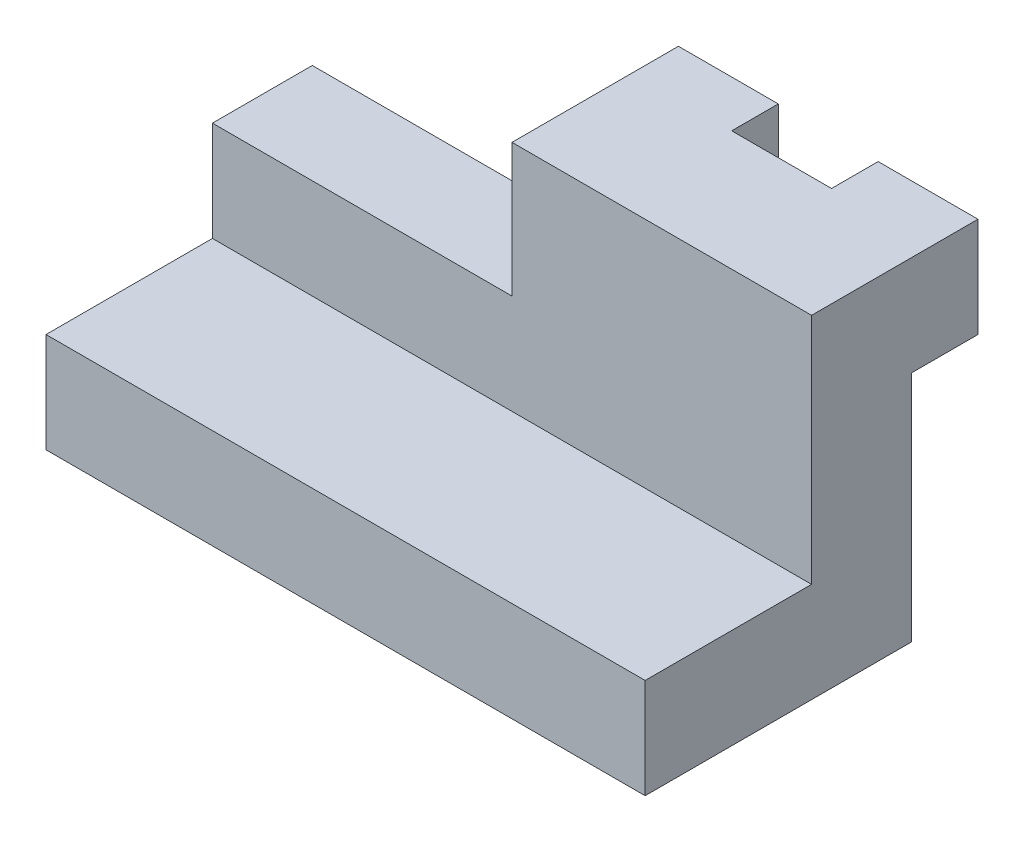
from build123d import *

# Parameters (mm, degrees)
SKETCH_1_W      = 90
SKETCH_1_H      = 40
EXTRUDE_1_DEPTH = 15
SKETCH_2_W      = 90
SKETCH_2_H      = 15
EXTRUDE_2_DEPTH = 15
SKETCH_3_W      = 45
SKETCH_3_H      = 15
EXTRUDE_3_DEPTH = 5
EXTRUDE_4_DEPTH = 15


with BuildPart() as part:
    # Sketch 1 → Extrude 1 (new body)
    with BuildSketch(Plane(origin=(0, 0, 0), x_dir=(1, 0, 0), z_dir=(0, 1, 0))):
        with Locations((45, 20)):
            Rectangle(SKETCH_1_W, SKETCH_1_H)
    extrude(amount=EXTRUDE_1_DEPTH)

    # Sketch 2 → Extrude 2 (add)
    with BuildSketch(Plane(origin=(0, 15, 0), x_dir=(1, 0, 0), z_dir=(0, 1, 0))):
        with Locations((45, 32.5)):
            Rectangle(SKETCH_2_W, SKETCH_2_H)
    extrude(amount=EXTRUDE_2_DEPTH)

    # Sketch 3 → Extrude 3 (add)
    with BuildSketch(Plane(origin=(0, 30, 0), x_dir=(1, 0, 0), z_dir=(0, 1, 0))):
        with Locations((67.5, 32.5)):
            Rectangle(SKETCH_3_W, SKETCH_3_H)
    extrude(amount=EXTRUDE_3_DEPTH)

    # Sketch 4 → Extrude 4 (add)
    with BuildSketch(Plane(origin=(0, 35, 0), x_dir=(1, 0, 0), z_dir=(0, 1, 0))):
        Polygon((45, 25), (45, 50), (60, 50), (60, 43), (75, 43), (75, 50), (90, 50), (90, 25), align=None)
    extrude(amount=EXTRUDE_4_DEPTH)


solid = part.part
